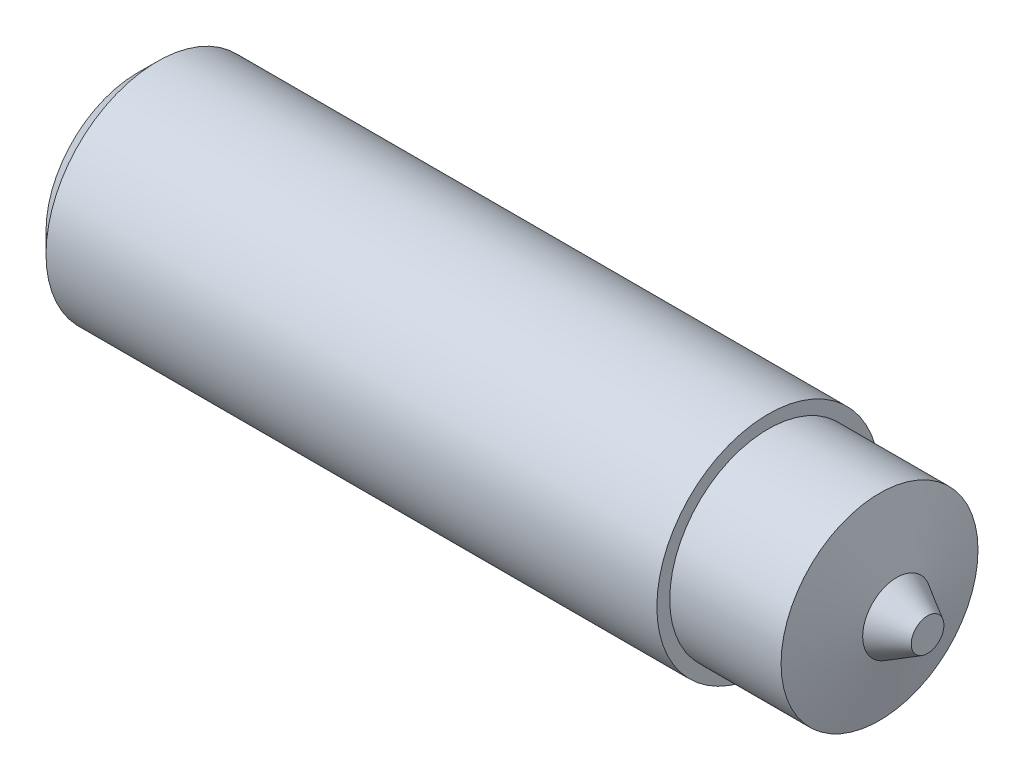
ISO-10303-21;
HEADER;
FILE_DESCRIPTION(('STEP AP214'),'2;1');
FILE_NAME('part.step','',(''),(''),'','','');
FILE_SCHEMA(('AUTOMOTIVE_DESIGN { 1 0 10303 214 1 1 1 1 }'));
ENDSEC;
DATA;
#1=APPLICATION_CONTEXT('core data for automotive mechanical design processes');
#2=APPLICATION_PROTOCOL_DEFINITION('international standard','automotive_design',2000,#1);
#3=PRODUCT_CONTEXT('',#1,'mechanical');
#4=PRODUCT('Part','Part','',(#3));
#5=PRODUCT_RELATED_PRODUCT_CATEGORY('part','',(#4));
#6=PRODUCT_DEFINITION_FORMATION('','',#4);
#7=PRODUCT_DEFINITION_CONTEXT('part definition',#1,'design');
#8=PRODUCT_DEFINITION('design','',#6,#7);
#9=PRODUCT_DEFINITION_SHAPE('','',#8);
#10=(LENGTH_UNIT() NAMED_UNIT(*) SI_UNIT(.MILLI.,.METRE.));
#11=(NAMED_UNIT(*) PLANE_ANGLE_UNIT() SI_UNIT($,.RADIAN.));
#12=(NAMED_UNIT(*) SI_UNIT($,.STERADIAN.) SOLID_ANGLE_UNIT());
#13=UNCERTAINTY_MEASURE_WITH_UNIT(LENGTH_MEASURE(1.E-05),#10,'distance_accuracy_value','');
#14=(GEOMETRIC_REPRESENTATION_CONTEXT(3) GLOBAL_UNCERTAINTY_ASSIGNED_CONTEXT((#13)) GLOBAL_UNIT_ASSIGNED_CONTEXT((#10,
#11,#12)) REPRESENTATION_CONTEXT('',''));
#15=CARTESIAN_POINT('',(0.,0.,0.));
#16=DIRECTION('',(0.,0.,1.));
#17=DIRECTION('',(1.,0.,0.));
#18=AXIS2_PLACEMENT_3D('',#15,#16,#17);
#19=CARTESIAN_POINT('',(0.,0.,0.));
#20=DIRECTION('',(1.,0.,0.));
#21=DIRECTION('',(0.,0.,-1.));
#22=AXIS2_PLACEMENT_3D('',#19,#20,#21);
#23=PLANE('',#22);
#24=CARTESIAN_POINT('',(0.,0.,0.));
#25=DIRECTION('',(1.,0.,0.));
#26=DIRECTION('',(0.,0.,-1.));
#27=AXIS2_PLACEMENT_3D('',#24,#25,#26);
#28=CIRCLE('',#27,2.4585);
#29=CARTESIAN_POINT('',(0.,0.,-2.4585));
#30=VERTEX_POINT('',#29);
#31=EDGE_CURVE('E46',#30,#30,#28,.F.);
#32=ORIENTED_EDGE('',*,*,#31,.T.);
#33=EDGE_LOOP('',(#32));
#34=FACE_BOUND('',#33,.T.);
#35=ADVANCED_FACE('F39',(#34),#23,.F.);
#36=CARTESIAN_POINT('',(-13.9508891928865,0.,0.));
#37=DIRECTION('',(-1.,0.,0.));
#38=DIRECTION('',(0.,0.,1.));
#39=AXIS2_PLACEMENT_3D('',#36,#37,#38);
#40=CYLINDRICAL_SURFACE('',#39,3.);
#41=CARTESIAN_POINT('',(0.541500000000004,0.,0.));
#42=DIRECTION('',(1.,0.,0.));
#43=DIRECTION('',(0.,0.,-1.));
#44=AXIS2_PLACEMENT_3D('',#41,#42,#43);
#45=CIRCLE('',#44,3.);
#46=CARTESIAN_POINT('',(0.541500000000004,0.,-3.));
#47=VERTEX_POINT('',#46);
#48=EDGE_CURVE('E10',#47,#47,#45,.T.);
#49=ORIENTED_EDGE('',*,*,#48,.T.);
#50=EDGE_LOOP('',(#49));
#51=FACE_BOUND('',#50,.T.);
#52=CARTESIAN_POINT('',(17.,0.,0.));
#53=DIRECTION('',(-1.,0.,0.));
#54=DIRECTION('',(0.,0.,1.));
#55=AXIS2_PLACEMENT_3D('',#52,#53,#54);
#56=CIRCLE('',#55,3.);
#57=CARTESIAN_POINT('',(17.,0.,3.));
#58=VERTEX_POINT('',#57);
#59=EDGE_CURVE('E49',#58,#58,#56,.T.);
#60=ORIENTED_EDGE('',*,*,#59,.T.);
#61=EDGE_LOOP('',(#60));
#62=FACE_BOUND('',#61,.T.);
#63=ADVANCED_FACE('F85',(#51,#62),#40,.T.);
#64=CARTESIAN_POINT('',(17.,3.,0.));
#65=DIRECTION('',(-1.,0.,0.));
#66=DIRECTION('',(0.,0.,1.));
#67=AXIS2_PLACEMENT_3D('',#64,#65,#66);
#68=PLANE('',#67);
#69=ORIENTED_EDGE('',*,*,#59,.F.);
#70=EDGE_LOOP('',(#69));
#71=FACE_BOUND('',#70,.T.);
#72=CARTESIAN_POINT('',(17.,0.,0.));
#73=DIRECTION('',(-1.,0.,0.));
#74=DIRECTION('',(0.,0.,1.));
#75=AXIS2_PLACEMENT_3D('',#72,#73,#74);
#76=CIRCLE('',#75,2.652751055);
#77=CARTESIAN_POINT('',(17.,0.,2.652751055));
#78=VERTEX_POINT('',#77);
#79=EDGE_CURVE('E53',#78,#78,#76,.T.);
#80=ORIENTED_EDGE('',*,*,#79,.T.);
#81=EDGE_LOOP('',(#80));
#82=FACE_BOUND('',#81,.T.);
#83=ADVANCED_FACE('F87',(#71,#82),#68,.F.);
#84=CARTESIAN_POINT('',(-13.9508891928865,0.,0.));
#85=DIRECTION('',(-1.,0.,0.));
#86=DIRECTION('',(0.,0.,1.));
#87=AXIS2_PLACEMENT_3D('',#84,#85,#86);
#88=CYLINDRICAL_SURFACE('',#87,2.652751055);
#89=ORIENTED_EDGE('',*,*,#79,.F.);
#90=EDGE_LOOP('',(#89));
#91=FACE_BOUND('',#90,.T.);
#92=CARTESIAN_POINT('',(20.,0.,0.));
#93=DIRECTION('',(-1.,0.,0.));
#94=DIRECTION('',(0.,0.,1.));
#95=AXIS2_PLACEMENT_3D('',#92,#93,#94);
#96=CIRCLE('',#95,2.652751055);
#97=CARTESIAN_POINT('',(20.,0.,2.652751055));
#98=VERTEX_POINT('',#97);
#99=EDGE_CURVE('E56',#98,#98,#96,.T.);
#100=ORIENTED_EDGE('',*,*,#99,.T.);
#101=EDGE_LOOP('',(#100));
#102=FACE_BOUND('',#101,.T.);
#103=ADVANCED_FACE('F95',(#91,#102),#88,.T.);
#104=CARTESIAN_POINT('',(20.4645034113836,0.,0.));
#105=DIRECTION('',(-1.,0.,0.));
#106=DIRECTION('',(0.,0.,1.));
#107=AXIS2_PLACEMENT_3D('',#104,#105,#106);
#108=CONICAL_SURFACE('',#107,0.919200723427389,1.30899693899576);
#109=ORIENTED_EDGE('',*,*,#99,.F.);
#110=EDGE_LOOP('',(#109));
#111=FACE_BOUND('',#110,.T.);
#112=CARTESIAN_POINT('',(20.4645034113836,0.,0.));
#113=DIRECTION('',(-1.,0.,0.));
#114=DIRECTION('',(0.,0.,1.));
#115=AXIS2_PLACEMENT_3D('',#112,#113,#114);
#116=CIRCLE('',#115,0.919200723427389);
#117=CARTESIAN_POINT('',(20.4645034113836,0.,0.919200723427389));
#118=VERTEX_POINT('',#117);
#119=EDGE_CURVE('E61',#118,#118,#116,.T.);
#120=ORIENTED_EDGE('',*,*,#119,.T.);
#121=EDGE_LOOP('',(#120));
#122=FACE_BOUND('',#121,.T.);
#123=ADVANCED_FACE('F78',(#111,#122),#108,.T.);
#124=CARTESIAN_POINT('',(21.2945034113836,0.,0.));
#125=DIRECTION('',(-1.,0.,0.));
#126=DIRECTION('',(0.,0.,1.));
#127=AXIS2_PLACEMENT_3D('',#124,#125,#126);
#128=CONICAL_SURFACE('',#127,0.44,0.5235987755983);
#129=ORIENTED_EDGE('',*,*,#119,.F.);
#130=EDGE_LOOP('',(#129));
#131=FACE_BOUND('',#130,.T.);
#132=CARTESIAN_POINT('',(21.2945034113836,0.,0.));
#133=DIRECTION('',(-1.,0.,0.));
#134=DIRECTION('',(0.,0.,1.));
#135=AXIS2_PLACEMENT_3D('',#132,#133,#134);
#136=CIRCLE('',#135,0.44);
#137=CARTESIAN_POINT('',(21.2945034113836,0.,0.44));
#138=VERTEX_POINT('',#137);
#139=EDGE_CURVE('E62',#138,#138,#136,.T.);
#140=ORIENTED_EDGE('',*,*,#139,.T.);
#141=EDGE_LOOP('',(#140));
#142=FACE_BOUND('',#141,.T.);
#143=ADVANCED_FACE('F70',(#131,#142),#128,.T.);
#144=CARTESIAN_POINT('',(21.2945034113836,0.44,0.));
#145=DIRECTION('',(-1.,0.,0.));
#146=DIRECTION('',(0.,0.,1.));
#147=AXIS2_PLACEMENT_3D('',#144,#145,#146);
#148=PLANE('',#147);
#149=ORIENTED_EDGE('',*,*,#139,.F.);
#150=EDGE_LOOP('',(#149));
#151=FACE_BOUND('',#150,.T.);
#152=ADVANCED_FACE('F74',(#151),#148,.F.);
#153=CARTESIAN_POINT('',(0.,0.,0.));
#154=DIRECTION('',(1.,0.,0.));
#155=DIRECTION('',(0.,0.,-1.));
#156=AXIS2_PLACEMENT_3D('',#153,#154,#155);
#157=CONICAL_SURFACE('',#156,2.4585,0.785398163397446);
#158=ORIENTED_EDGE('',*,*,#48,.F.);
#159=EDGE_LOOP('',(#158));
#160=FACE_BOUND('',#159,.T.);
#161=ORIENTED_EDGE('',*,*,#31,.F.);
#162=EDGE_LOOP('',(#161));
#163=FACE_BOUND('',#162,.T.);
#164=ADVANCED_FACE('F41',(#160,#163),#157,.T.);
#165=CLOSED_SHELL('',(#35,#63,#83,#103,#123,#143,#152,#164));
#166=MANIFOLD_SOLID_BREP('B2',#165);
#167=ADVANCED_BREP_SHAPE_REPRESENTATION('',(#18,#166),#14);
#168=SHAPE_DEFINITION_REPRESENTATION(#9,#167);
ENDSEC;
END-ISO-10303-21;
